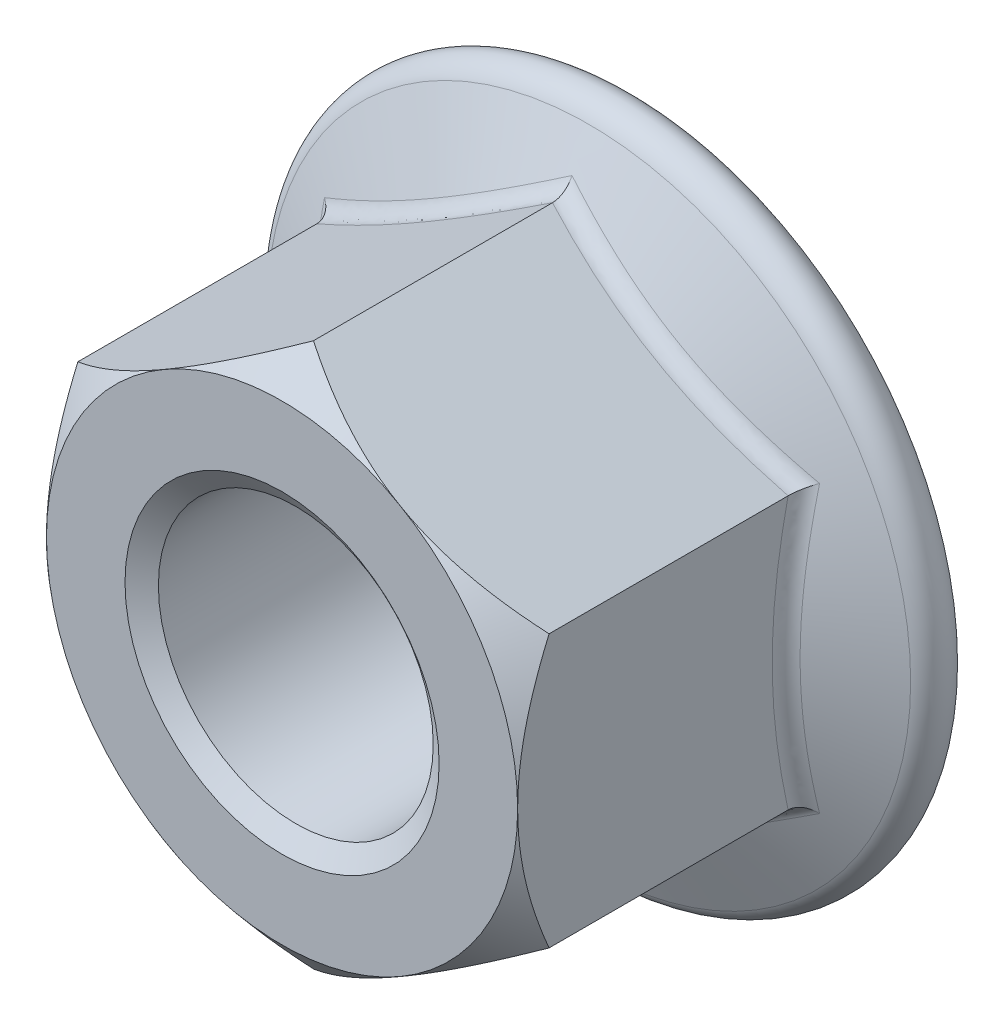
from build123d import *

# Parameters (mm, degrees)
BASENUTSKE_R   = 8.75
BASENUT_DEPTH  = 22.5298
FLANGEFILLET_R = 1.2


with BuildPart() as part:
    # BaseNutSke → BaseNut (new body)
    with BuildSketch(Plane.XY):
        Polygon((15, 8.660254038), (15, -8.660254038), (0, -17.320508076), (-15, -8.660254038), (-15, 8.660254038), (0, 17.320508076), align=None)
        Circle(BASENUTSKE_R, mode=Mode.SUBTRACT)
    extrude(amount=-BASENUT_DEPTH)

    # Sketch6 → Flange (revolve)
    with BuildSketch(Plane(origin=(0, 0, 0), x_dir=(0, 0, -1), z_dir=(1, 0, 0)), mode=Mode.PRIVATE) as flange_sk:
        with BuildLine():
            Line((14.054713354, 8.75), (19.5298, 20.491361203))
            ThreePointArc((19.5298, 20.491361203), (21.296693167, 21.362696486), (22.5298, 19.826277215))
            Line((22.5298, 19.826277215), (22.5298, 8.75))
            Line((22.5298, 8.75), (14.054713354, 8.75))
        make_face()
    revolve(flange_sk.sketch.rotate(Axis((0, 0, 0), (0, 0, -1)), 90), axis=Axis((0, 0, 0), (0, 0, -1)))

    # Sketch3 → Double-Chamfer (revolve, cut)
    with BuildSketch(Plane(origin=(0, 0, 0), x_dir=(0, 0, -1), z_dir=(1, 0, 0)), mode=Mode.PRIVATE) as double_chamfer_sk:
        Polygon((2, 30.020508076), (-12.7, 30.020508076), (-12.7, 15), (0, 15), (2, 17.320508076), align=None)
    revolve(double_chamfer_sk.sketch.rotate(Axis((0, 0, 0), (0, 0, -1)), 90), axis=Axis((0, 0, 0), (0, 0, -1)), mode=Mode.SUBTRACT)

    # FlangeFillet
    flangefillet_edges = [part.edges().sort_by_distance(p)[0] for p in [
        (15, -4.360902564, -17.25874059),
        (15, 4.360902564, -17.25874059),
        (7.5, -12.990381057, -16.969136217),
        (7.5, 12.990381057, -16.969136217),
        (-7.5, 12.990381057, -16.969136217),
        (-15, 0, -16.969136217),
        (-7.5, -12.990381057, -16.969136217),
    ]]
    fillet(flangefillet_edges, radius=FLANGEFILLET_R)

    # Sketch5 → EndChamfer (revolve, cut)
    with BuildSketch(Plane(origin=(0, 0, 0), x_dir=(0, 0, -1), z_dir=(1, 0, 0)), mode=Mode.PRIVATE) as endchamfer_sk:
        Polygon((22.5044, 10), (21.541614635, 8.625), (22.5552, 8.625), (22.5552, 10), align=None)
        Polygon((-0.0508, 10), (0, 10), (0.962785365, 8.625), (-0.0508, 8.625), align=None)
    revolve(endchamfer_sk.sketch.rotate(Axis((0, 0, -25.037505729), (0, 0, -1)), 90), axis=Axis((0, 0, -25.037505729), (0, 0, -1)), mode=Mode.SUBTRACT)


solid = part.part
